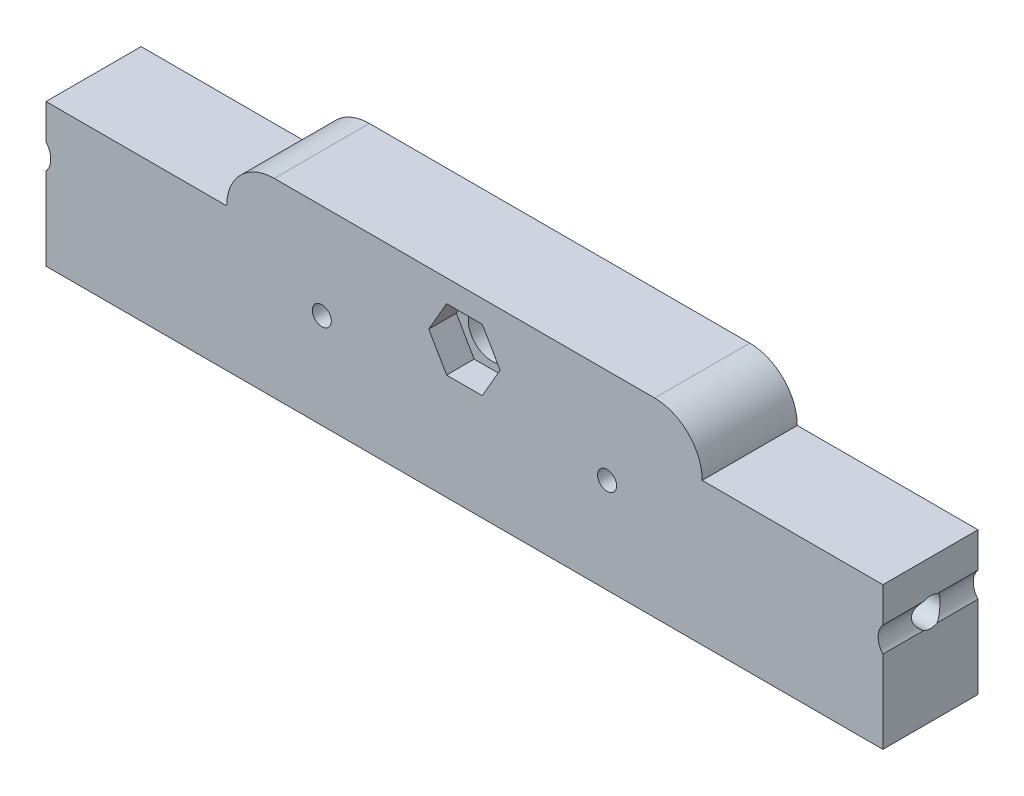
ISO-10303-21;
HEADER;
FILE_DESCRIPTION(('STEP AP214'),'2;1');
FILE_NAME('part.step','',(''),(''),'','','');
FILE_SCHEMA(('AUTOMOTIVE_DESIGN { 1 0 10303 214 1 1 1 1 }'));
ENDSEC;
DATA;
#1=APPLICATION_CONTEXT('core data for automotive mechanical design processes');
#2=APPLICATION_PROTOCOL_DEFINITION('international standard','automotive_design',2000,#1);
#3=PRODUCT_CONTEXT('',#1,'mechanical');
#4=PRODUCT('Part','Part','',(#3));
#5=PRODUCT_RELATED_PRODUCT_CATEGORY('part','',(#4));
#6=PRODUCT_DEFINITION_FORMATION('','',#4);
#7=PRODUCT_DEFINITION_CONTEXT('part definition',#1,'design');
#8=PRODUCT_DEFINITION('design','',#6,#7);
#9=PRODUCT_DEFINITION_SHAPE('','',#8);
#10=(LENGTH_UNIT() NAMED_UNIT(*) SI_UNIT(.MILLI.,.METRE.));
#11=(NAMED_UNIT(*) PLANE_ANGLE_UNIT() SI_UNIT($,.RADIAN.));
#12=(NAMED_UNIT(*) SI_UNIT($,.STERADIAN.) SOLID_ANGLE_UNIT());
#13=UNCERTAINTY_MEASURE_WITH_UNIT(LENGTH_MEASURE(1.E-05),#10,'distance_accuracy_value','');
#14=(GEOMETRIC_REPRESENTATION_CONTEXT(3) GLOBAL_UNCERTAINTY_ASSIGNED_CONTEXT((#13)) GLOBAL_UNIT_ASSIGNED_CONTEXT((#10,
#11,#12)) REPRESENTATION_CONTEXT('',''));
#15=CARTESIAN_POINT('',(0.,0.,0.));
#16=DIRECTION('',(0.,0.,1.));
#17=DIRECTION('',(1.,0.,0.));
#18=AXIS2_PLACEMENT_3D('',#15,#16,#17);
#19=CARTESIAN_POINT('',(-36.0445215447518,18.2909025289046,0.));
#20=DIRECTION('',(0.,0.,1.));
#21=DIRECTION('',(1.,0.,0.));
#22=AXIS2_PLACEMENT_3D('',#19,#20,#21);
#23=CYLINDRICAL_SURFACE('',#22,2.49999999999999);
#24=CARTESIAN_POINT('',(-36.0445215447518,18.2909025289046,0.));
#25=DIRECTION('',(0.,0.,1.));
#26=DIRECTION('',(1.,0.,0.));
#27=AXIS2_PLACEMENT_3D('',#24,#25,#26);
#28=CIRCLE('',#27,2.49999999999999);
#29=CARTESIAN_POINT('',(-33.5445215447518,18.2909025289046,0.));
#30=VERTEX_POINT('',#29);
#31=EDGE_CURVE('E294',#30,#30,#28,.T.);
#32=ORIENTED_EDGE('',*,*,#31,.F.);
#33=EDGE_LOOP('',(#32));
#34=FACE_BOUND('',#33,.T.);
#35=CARTESIAN_POINT('',(-36.0445215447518,18.2909025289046,7.1));
#36=DIRECTION('',(0.,0.,1.));
#37=DIRECTION('',(1.,0.,0.));
#38=AXIS2_PLACEMENT_3D('',#35,#36,#37);
#39=CIRCLE('',#38,2.49999999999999);
#40=CARTESIAN_POINT('',(-33.5445215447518,18.2909025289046,7.1));
#41=VERTEX_POINT('',#40);
#42=EDGE_CURVE('E235',#41,#41,#39,.F.);
#43=ORIENTED_EDGE('',*,*,#42,.F.);
#44=EDGE_LOOP('',(#43));
#45=FACE_BOUND('',#44,.T.);
#46=ADVANCED_FACE('F34',(#34,#45),#23,.F.);
#47=CARTESIAN_POINT('',(-80.0445215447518,18.8909025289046,10.));
#48=DIRECTION('',(1.,0.,0.));
#49=DIRECTION('',(0.,0.,-1.));
#50=AXIS2_PLACEMENT_3D('',#47,#48,#49);
#51=PLANE('',#50);
#52=DIRECTION('',(0.,-1.,0.));
#53=VECTOR('',#52,1.);
#54=CARTESIAN_POINT('',(-80.0445215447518,18.8909025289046,0.));
#55=LINE('',#54,#53);
#56=CARTESIAN_POINT('',(-80.0445215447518,18.8909025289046,0.));
#57=VERTEX_POINT('',#56);
#58=CARTESIAN_POINT('',(-80.0445215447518,15.213778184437,0.));
#59=VERTEX_POINT('',#58);
#60=EDGE_CURVE('E309',#57,#59,#55,.T.);
#61=ORIENTED_EDGE('',*,*,#60,.T.);
#62=DIRECTION('',(0.,0.,1.));
#63=VECTOR('',#62,1.);
#64=CARTESIAN_POINT('',(-80.0445215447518,15.213778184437,0.));
#65=LINE('',#64,#63);
#66=CARTESIAN_POINT('',(-80.0445215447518,15.213778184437,4.29289321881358));
#67=VERTEX_POINT('',#66);
#68=EDGE_CURVE('E250',#59,#67,#65,.T.);
#69=ORIENTED_EDGE('',*,*,#68,.T.);
#70=CARTESIAN_POINT('',(-80.0445215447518,13.8909025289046,5.));
#71=DIRECTION('',(-1.,0.,0.));
#72=DIRECTION('',(0.,0.,1.));
#73=AXIS2_PLACEMENT_3D('',#70,#71,#72);
#74=CIRCLE('',#73,1.5);
#75=CARTESIAN_POINT('',(-80.0445215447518,15.213778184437,5.70710678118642));
#76=VERTEX_POINT('',#75);
#77=EDGE_CURVE('E276',#76,#67,#74,.T.);
#78=ORIENTED_EDGE('',*,*,#77,.F.);
#79=CARTESIAN_POINT('',(-80.0445215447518,15.213778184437,10.));
#80=VERTEX_POINT('',#79);
#81=EDGE_CURVE('E254',#76,#80,#65,.T.);
#82=ORIENTED_EDGE('',*,*,#81,.T.);
#83=DIRECTION('',(0.,-1.,0.));
#84=VECTOR('',#83,1.);
#85=CARTESIAN_POINT('',(-80.0445215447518,18.8909025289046,10.));
#86=LINE('',#85,#84);
#87=CARTESIAN_POINT('',(-80.0445215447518,18.8909025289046,10.));
#88=VERTEX_POINT('',#87);
#89=EDGE_CURVE('E325',#88,#80,#86,.T.);
#90=ORIENTED_EDGE('',*,*,#89,.F.);
#91=DIRECTION('',(0.,0.,-1.));
#92=VECTOR('',#91,1.);
#93=CARTESIAN_POINT('',(-80.0445215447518,18.8909025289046,10.));
#94=LINE('',#93,#92);
#95=EDGE_CURVE('E336',#88,#57,#94,.T.);
#96=ORIENTED_EDGE('',*,*,#95,.T.);
#97=EDGE_LOOP('',(#61,#69,#78,#82,#90,#96));
#98=FACE_BOUND('',#97,.T.);
#99=ADVANCED_FACE('F387',(#98),#51,.F.);
#100=CARTESIAN_POINT('',(7.95547845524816,18.8909025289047,10.));
#101=DIRECTION('',(-1.,0.,0.));
#102=DIRECTION('',(0.,0.,1.));
#103=AXIS2_PLACEMENT_3D('',#100,#101,#102);
#104=PLANE('',#103);
#105=DIRECTION('',(0.,1.,0.));
#106=VECTOR('',#105,1.);
#107=CARTESIAN_POINT('',(7.95547845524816,18.8909025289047,0.));
#108=LINE('',#107,#106);
#109=CARTESIAN_POINT('',(7.95547845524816,3.89090252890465,0.));
#110=VERTEX_POINT('',#109);
#111=CARTESIAN_POINT('',(7.95547845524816,12.5680268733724,0.));
#112=VERTEX_POINT('',#111);
#113=EDGE_CURVE('E298',#110,#112,#108,.T.);
#114=ORIENTED_EDGE('',*,*,#113,.T.);
#115=DIRECTION('',(0.,0.,1.));
#116=VECTOR('',#115,1.);
#117=CARTESIAN_POINT('',(7.95547845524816,12.5680268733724,0.));
#118=LINE('',#117,#116);
#119=CARTESIAN_POINT('',(7.95547845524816,12.5680268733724,4.29289321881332));
#120=VERTEX_POINT('',#119);
#121=EDGE_CURVE('E267',#112,#120,#118,.T.);
#122=ORIENTED_EDGE('',*,*,#121,.T.);
#123=CARTESIAN_POINT('',(7.95547845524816,13.8909025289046,5.));
#124=DIRECTION('',(1.,0.,0.));
#125=DIRECTION('',(0.,1.,0.));
#126=AXIS2_PLACEMENT_3D('',#123,#124,#125);
#127=CIRCLE('',#126,1.5);
#128=CARTESIAN_POINT('',(7.95547845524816,12.5680268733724,5.70710678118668));
#129=VERTEX_POINT('',#128);
#130=EDGE_CURVE('E271',#129,#120,#127,.T.);
#131=ORIENTED_EDGE('',*,*,#130,.F.);
#132=CARTESIAN_POINT('',(7.95547845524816,12.5680268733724,10.));
#133=VERTEX_POINT('',#132);
#134=EDGE_CURVE('E263',#129,#133,#118,.T.);
#135=ORIENTED_EDGE('',*,*,#134,.T.);
#136=DIRECTION('',(0.,1.,0.));
#137=VECTOR('',#136,1.);
#138=CARTESIAN_POINT('',(7.95547845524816,18.8909025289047,10.));
#139=LINE('',#138,#137);
#140=CARTESIAN_POINT('',(7.95547845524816,3.89090252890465,10.));
#141=VERTEX_POINT('',#140);
#142=EDGE_CURVE('E315',#141,#133,#139,.T.);
#143=ORIENTED_EDGE('',*,*,#142,.F.);
#144=DIRECTION('',(0.,0.,-1.));
#145=VECTOR('',#144,1.);
#146=CARTESIAN_POINT('',(7.95547845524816,3.89090252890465,10.));
#147=LINE('',#146,#145);
#148=EDGE_CURVE('E330',#141,#110,#147,.T.);
#149=ORIENTED_EDGE('',*,*,#148,.T.);
#150=EDGE_LOOP('',(#114,#122,#131,#135,#143,#149));
#151=FACE_BOUND('',#150,.T.);
#152=ADVANCED_FACE('F393',(#151),#104,.F.);
#153=CARTESIAN_POINT('',(7.95547845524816,15.213778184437,10.));
#154=VERTEX_POINT('',#153);
#155=CARTESIAN_POINT('',(7.95547845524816,18.8909025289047,10.));
#156=VERTEX_POINT('',#155);
#157=EDGE_CURVE('E314',#154,#156,#139,.T.);
#158=ORIENTED_EDGE('',*,*,#157,.F.);
#159=DIRECTION('',(0.,0.,1.));
#160=VECTOR('',#159,1.);
#161=CARTESIAN_POINT('',(7.95547845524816,15.213778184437,0.));
#162=LINE('',#161,#160);
#163=CARTESIAN_POINT('',(7.95547845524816,15.213778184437,5.7071067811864));
#164=VERTEX_POINT('',#163);
#165=EDGE_CURVE('E260',#154,#164,#162,.F.);
#166=ORIENTED_EDGE('',*,*,#165,.T.);
#167=CARTESIAN_POINT('',(7.95547845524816,15.213778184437,4.2928932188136));
#168=VERTEX_POINT('',#167);
#169=EDGE_CURVE('E268',#168,#164,#127,.T.);
#170=ORIENTED_EDGE('',*,*,#169,.F.);
#171=CARTESIAN_POINT('',(7.95547845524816,15.213778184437,0.));
#172=VERTEX_POINT('',#171);
#173=EDGE_CURVE('E264',#168,#172,#162,.F.);
#174=ORIENTED_EDGE('',*,*,#173,.T.);
#175=CARTESIAN_POINT('',(7.95547845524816,18.8909025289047,0.));
#176=VERTEX_POINT('',#175);
#177=EDGE_CURVE('E297',#172,#176,#108,.T.);
#178=ORIENTED_EDGE('',*,*,#177,.T.);
#179=DIRECTION('',(0.,0.,-1.));
#180=VECTOR('',#179,1.);
#181=CARTESIAN_POINT('',(7.95547845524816,18.8909025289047,10.));
#182=LINE('',#181,#180);
#183=EDGE_CURVE('E345',#156,#176,#182,.T.);
#184=ORIENTED_EDGE('',*,*,#183,.F.);
#185=EDGE_LOOP('',(#158,#166,#170,#174,#178,#184));
#186=FACE_BOUND('',#185,.T.);
#187=ADVANCED_FACE('F36',(#186),#104,.F.);
#188=CARTESIAN_POINT('',(7.95547845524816,18.8909025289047,10.));
#189=DIRECTION('',(0.,-1.,0.));
#190=DIRECTION('',(0.,0.,-1.));
#191=AXIS2_PLACEMENT_3D('',#188,#189,#190);
#192=PLANE('',#191);
#193=DIRECTION('',(-1.,0.,0.));
#194=VECTOR('',#193,1.);
#195=CARTESIAN_POINT('',(7.95547845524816,18.8909025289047,0.));
#196=LINE('',#195,#194);
#197=CARTESIAN_POINT('',(-11.0445215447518,18.8909025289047,0.));
#198=VERTEX_POINT('',#197);
#199=EDGE_CURVE('E301',#176,#198,#196,.T.);
#200=ORIENTED_EDGE('',*,*,#199,.T.);
#201=DIRECTION('',(0.,0.,-1.));
#202=VECTOR('',#201,1.);
#203=CARTESIAN_POINT('',(-11.0445215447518,18.8909025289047,10.));
#204=LINE('',#203,#202);
#205=CARTESIAN_POINT('',(-11.0445215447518,18.8909025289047,10.));
#206=VERTEX_POINT('',#205);
#207=EDGE_CURVE('E342',#206,#198,#204,.T.);
#208=ORIENTED_EDGE('',*,*,#207,.F.);
#209=DIRECTION('',(-1.,0.,0.));
#210=VECTOR('',#209,1.);
#211=CARTESIAN_POINT('',(7.95547845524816,18.8909025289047,10.));
#212=LINE('',#211,#210);
#213=EDGE_CURVE('E318',#156,#206,#212,.T.);
#214=ORIENTED_EDGE('',*,*,#213,.F.);
#215=ORIENTED_EDGE('',*,*,#183,.T.);
#216=EDGE_LOOP('',(#200,#208,#214,#215));
#217=FACE_BOUND('',#216,.T.);
#218=ADVANCED_FACE('F421',(#217),#192,.F.);
#219=CARTESIAN_POINT('',(-61.0445215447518,23.8909025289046,10.));
#220=DIRECTION('',(0.,-1.,0.));
#221=DIRECTION('',(1.,0.,0.));
#222=AXIS2_PLACEMENT_3D('',#219,#220,#221);
#223=PLANE('',#222);
#224=DIRECTION('',(-1.,0.,0.));
#225=VECTOR('',#224,1.);
#226=CARTESIAN_POINT('',(-61.0445215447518,23.8909025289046,10.));
#227=LINE('',#226,#225);
#228=CARTESIAN_POINT('',(-16.0445215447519,23.8909025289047,10.));
#229=VERTEX_POINT('',#228);
#230=CARTESIAN_POINT('',(-56.0445215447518,23.8909025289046,10.));
#231=VERTEX_POINT('',#230);
#232=EDGE_CURVE('E320',#229,#231,#227,.T.);
#233=ORIENTED_EDGE('',*,*,#232,.F.);
#234=DIRECTION('',(0.,0.,-1.));
#235=VECTOR('',#234,1.);
#236=CARTESIAN_POINT('',(-16.0445215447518,23.8909025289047,10.));
#237=LINE('',#236,#235);
#238=CARTESIAN_POINT('',(-16.0445215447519,23.8909025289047,0.));
#239=VERTEX_POINT('',#238);
#240=EDGE_CURVE('E439',#229,#239,#237,.T.);
#241=ORIENTED_EDGE('',*,*,#240,.T.);
#242=DIRECTION('',(-1.,0.,0.));
#243=VECTOR('',#242,1.);
#244=CARTESIAN_POINT('',(-61.0445215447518,23.8909025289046,0.));
#245=LINE('',#244,#243);
#246=CARTESIAN_POINT('',(-56.0445215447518,23.8909025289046,0.));
#247=VERTEX_POINT('',#246);
#248=EDGE_CURVE('E304',#239,#247,#245,.T.);
#249=ORIENTED_EDGE('',*,*,#248,.T.);
#250=DIRECTION('',(0.,0.,-1.));
#251=VECTOR('',#250,1.);
#252=CARTESIAN_POINT('',(-56.0445215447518,23.8909025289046,10.));
#253=LINE('',#252,#251);
#254=EDGE_CURVE('E49',#247,#231,#253,.F.);
#255=ORIENTED_EDGE('',*,*,#254,.T.);
#256=EDGE_LOOP('',(#233,#241,#249,#255));
#257=FACE_BOUND('',#256,.T.);
#258=ADVANCED_FACE('F418',(#257),#223,.F.);
#259=CARTESIAN_POINT('',(-61.0445215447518,18.8909025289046,10.));
#260=DIRECTION('',(0.,-1.,0.));
#261=DIRECTION('',(0.,0.,-1.));
#262=AXIS2_PLACEMENT_3D('',#259,#260,#261);
#263=PLANE('',#262);
#264=DIRECTION('',(-1.,0.,0.));
#265=VECTOR('',#264,1.);
#266=CARTESIAN_POINT('',(-61.0445215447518,18.8909025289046,0.));
#267=LINE('',#266,#265);
#268=CARTESIAN_POINT('',(-61.0445215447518,18.8909025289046,0.));
#269=VERTEX_POINT('',#268);
#270=EDGE_CURVE('E306',#269,#57,#267,.T.);
#271=ORIENTED_EDGE('',*,*,#270,.T.);
#272=ORIENTED_EDGE('',*,*,#95,.F.);
#273=DIRECTION('',(-1.,0.,0.));
#274=VECTOR('',#273,1.);
#275=CARTESIAN_POINT('',(-61.0445215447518,18.8909025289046,10.));
#276=LINE('',#275,#274);
#277=CARTESIAN_POINT('',(-61.0445215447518,18.8909025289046,10.));
#278=VERTEX_POINT('',#277);
#279=EDGE_CURVE('E322',#278,#88,#276,.T.);
#280=ORIENTED_EDGE('',*,*,#279,.F.);
#281=DIRECTION('',(0.,0.,-1.));
#282=VECTOR('',#281,1.);
#283=CARTESIAN_POINT('',(-61.0445215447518,18.8909025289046,10.));
#284=LINE('',#283,#282);
#285=EDGE_CURVE('E339',#278,#269,#284,.T.);
#286=ORIENTED_EDGE('',*,*,#285,.T.);
#287=EDGE_LOOP('',(#271,#272,#280,#286));
#288=FACE_BOUND('',#287,.T.);
#289=ADVANCED_FACE('F414',(#288),#263,.F.);
#290=CARTESIAN_POINT('',(-80.0445215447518,12.5680268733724,10.));
#291=VERTEX_POINT('',#290);
#292=CARTESIAN_POINT('',(-80.0445215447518,3.89090252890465,10.));
#293=VERTEX_POINT('',#292);
#294=EDGE_CURVE('E324',#291,#293,#86,.T.);
#295=ORIENTED_EDGE('',*,*,#294,.F.);
#296=DIRECTION('',(0.,0.,1.));
#297=VECTOR('',#296,1.);
#298=CARTESIAN_POINT('',(-80.0445215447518,12.5680268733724,0.));
#299=LINE('',#298,#297);
#300=CARTESIAN_POINT('',(-80.0445215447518,12.5680268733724,5.70710678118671));
#301=VERTEX_POINT('',#300);
#302=EDGE_CURVE('E251',#291,#301,#299,.F.);
#303=ORIENTED_EDGE('',*,*,#302,.T.);
#304=CARTESIAN_POINT('',(-80.0445215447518,12.5680268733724,4.29289321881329));
#305=VERTEX_POINT('',#304);
#306=EDGE_CURVE('E275',#305,#301,#74,.T.);
#307=ORIENTED_EDGE('',*,*,#306,.F.);
#308=CARTESIAN_POINT('',(-80.0445215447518,12.5680268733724,0.));
#309=VERTEX_POINT('',#308);
#310=EDGE_CURVE('E247',#305,#309,#299,.F.);
#311=ORIENTED_EDGE('',*,*,#310,.T.);
#312=CARTESIAN_POINT('',(-80.0445215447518,3.89090252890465,0.));
#313=VERTEX_POINT('',#312);
#314=EDGE_CURVE('E308',#309,#313,#55,.T.);
#315=ORIENTED_EDGE('',*,*,#314,.T.);
#316=DIRECTION('',(0.,0.,-1.));
#317=VECTOR('',#316,1.);
#318=CARTESIAN_POINT('',(-80.0445215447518,3.89090252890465,10.));
#319=LINE('',#318,#317);
#320=EDGE_CURVE('E333',#293,#313,#319,.T.);
#321=ORIENTED_EDGE('',*,*,#320,.F.);
#322=EDGE_LOOP('',(#295,#303,#307,#311,#315,#321));
#323=FACE_BOUND('',#322,.T.);
#324=ADVANCED_FACE('F396',(#323),#51,.F.);
#325=CARTESIAN_POINT('',(-80.0445215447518,3.89090252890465,10.));
#326=DIRECTION('',(0.,1.,0.));
#327=DIRECTION('',(0.,0.,1.));
#328=AXIS2_PLACEMENT_3D('',#325,#326,#327);
#329=PLANE('',#328);
#330=DIRECTION('',(1.,0.,0.));
#331=VECTOR('',#330,1.);
#332=CARTESIAN_POINT('',(-80.0445215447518,3.89090252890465,0.));
#333=LINE('',#332,#331);
#334=EDGE_CURVE('E312',#313,#110,#333,.T.);
#335=ORIENTED_EDGE('',*,*,#334,.T.);
#336=ORIENTED_EDGE('',*,*,#148,.F.);
#337=DIRECTION('',(1.,0.,0.));
#338=VECTOR('',#337,1.);
#339=CARTESIAN_POINT('',(-80.0445215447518,3.89090252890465,10.));
#340=LINE('',#339,#338);
#341=EDGE_CURVE('E328',#293,#141,#340,.T.);
#342=ORIENTED_EDGE('',*,*,#341,.F.);
#343=ORIENTED_EDGE('',*,*,#320,.T.);
#344=EDGE_LOOP('',(#335,#336,#342,#343));
#345=FACE_BOUND('',#344,.T.);
#346=ADVANCED_FACE('F409',(#345),#329,.F.);
#347=CARTESIAN_POINT('',(7.95547845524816,3.89090252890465,10.));
#348=DIRECTION('',(0.,0.,1.));
#349=DIRECTION('',(1.,0.,0.));
#350=AXIS2_PLACEMENT_3D('',#347,#348,#349);
#351=PLANE('',#350);
#352=DIRECTION('',(1.,0.,0.));
#353=VECTOR('',#352,1.);
#354=CARTESIAN_POINT('',(-37.9209099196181,15.0409025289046,10.));
#355=LINE('',#354,#353);
#356=CARTESIAN_POINT('',(-37.9209099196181,15.0409025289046,10.));
#357=VERTEX_POINT('',#356);
#358=CARTESIAN_POINT('',(-34.1681331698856,15.0409025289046,10.));
#359=VERTEX_POINT('',#358);
#360=EDGE_CURVE('E202',#357,#359,#355,.T.);
#361=ORIENTED_EDGE('',*,*,#360,.F.);
#362=DIRECTION('',(0.5,-0.866025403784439,0.));
#363=VECTOR('',#362,1.);
#364=CARTESIAN_POINT('',(-39.7972982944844,18.2909025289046,10.));
#365=LINE('',#364,#363);
#366=CARTESIAN_POINT('',(-39.7972982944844,18.2909025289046,10.));
#367=VERTEX_POINT('',#366);
#368=EDGE_CURVE('E215',#367,#357,#365,.T.);
#369=ORIENTED_EDGE('',*,*,#368,.F.);
#370=DIRECTION('',(-0.5,-0.866025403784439,0.));
#371=VECTOR('',#370,1.);
#372=CARTESIAN_POINT('',(-37.9209099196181,21.5409025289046,10.));
#373=LINE('',#372,#371);
#374=CARTESIAN_POINT('',(-37.9209099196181,21.5409025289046,10.));
#375=VERTEX_POINT('',#374);
#376=EDGE_CURVE('E209',#375,#367,#373,.T.);
#377=ORIENTED_EDGE('',*,*,#376,.F.);
#378=DIRECTION('',(-1.,0.,0.));
#379=VECTOR('',#378,1.);
#380=CARTESIAN_POINT('',(-34.1681331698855,21.5409025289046,10.));
#381=LINE('',#380,#379);
#382=CARTESIAN_POINT('',(-34.1681331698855,21.5409025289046,10.));
#383=VERTEX_POINT('',#382);
#384=EDGE_CURVE('E207',#383,#375,#381,.T.);
#385=ORIENTED_EDGE('',*,*,#384,.F.);
#386=DIRECTION('',(-0.5,0.866025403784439,0.));
#387=VECTOR('',#386,1.);
#388=CARTESIAN_POINT('',(-32.2917447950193,18.2909025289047,10.));
#389=LINE('',#388,#387);
#390=CARTESIAN_POINT('',(-32.2917447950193,18.2909025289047,10.));
#391=VERTEX_POINT('',#390);
#392=EDGE_CURVE('E186',#391,#383,#389,.T.);
#393=ORIENTED_EDGE('',*,*,#392,.F.);
#394=DIRECTION('',(0.499999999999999,0.866025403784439,0.));
#395=VECTOR('',#394,1.);
#396=CARTESIAN_POINT('',(-34.1681331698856,15.0409025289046,10.));
#397=LINE('',#396,#395);
#398=EDGE_CURVE('E198',#359,#391,#397,.T.);
#399=ORIENTED_EDGE('',*,*,#398,.F.);
#400=EDGE_LOOP('',(#361,#369,#377,#385,#393,#399));
#401=FACE_BOUND('',#400,.T.);
#402=ORIENTED_EDGE('',*,*,#213,.T.);
#403=CARTESIAN_POINT('',(-16.0445215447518,18.8909025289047,10.));
#404=DIRECTION('',(0.,0.,1.));
#405=DIRECTION('',(1.,0.,0.));
#406=AXIS2_PLACEMENT_3D('',#403,#404,#405);
#407=CIRCLE('',#406,5.);
#408=EDGE_CURVE('E12',#206,#229,#407,.T.);
#409=ORIENTED_EDGE('',*,*,#408,.T.);
#410=ORIENTED_EDGE('',*,*,#232,.T.);
#411=CARTESIAN_POINT('',(-56.0445215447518,18.8909025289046,10.));
#412=DIRECTION('',(0.,0.,1.));
#413=DIRECTION('',(1.,0.,0.));
#414=AXIS2_PLACEMENT_3D('',#411,#412,#413);
#415=CIRCLE('',#414,5.);
#416=EDGE_CURVE('E42',#231,#278,#415,.T.);
#417=ORIENTED_EDGE('',*,*,#416,.T.);
#418=ORIENTED_EDGE('',*,*,#279,.T.);
#419=ORIENTED_EDGE('',*,*,#89,.T.);
#420=CARTESIAN_POINT('',(-81.5445215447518,13.8909025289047,10.));
#421=DIRECTION('',(0.,0.,1.));
#422=DIRECTION('',(1.,0.,0.));
#423=AXIS2_PLACEMENT_3D('',#420,#421,#422);
#424=CIRCLE('',#423,2.);
#425=EDGE_CURVE('E242',#291,#80,#424,.T.);
#426=ORIENTED_EDGE('',*,*,#425,.F.);
#427=ORIENTED_EDGE('',*,*,#294,.T.);
#428=ORIENTED_EDGE('',*,*,#341,.T.);
#429=ORIENTED_EDGE('',*,*,#142,.T.);
#430=CARTESIAN_POINT('',(9.45547845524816,13.8909025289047,10.));
#431=DIRECTION('',(0.,0.,1.));
#432=DIRECTION('',(1.,0.,0.));
#433=AXIS2_PLACEMENT_3D('',#430,#431,#432);
#434=CIRCLE('',#433,2.00000000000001);
#435=EDGE_CURVE('E255',#154,#133,#434,.T.);
#436=ORIENTED_EDGE('',*,*,#435,.F.);
#437=ORIENTED_EDGE('',*,*,#157,.T.);
#438=EDGE_LOOP('',(#402,#409,#410,#417,#418,#419,#426,#427,#428,#429,#436,#437));
#439=FACE_BOUND('',#438,.T.);
#440=CARTESIAN_POINT('',(-51.0445215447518,13.8909025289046,10.));
#441=DIRECTION('',(0.,0.,1.));
#442=DIRECTION('',(1.,0.,0.));
#443=AXIS2_PLACEMENT_3D('',#440,#441,#442);
#444=CIRCLE('',#443,0.999999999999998);
#445=CARTESIAN_POINT('',(-50.0445215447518,13.8909025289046,10.));
#446=VERTEX_POINT('',#445);
#447=EDGE_CURVE('E282',#446,#446,#444,.T.);
#448=ORIENTED_EDGE('',*,*,#447,.F.);
#449=EDGE_LOOP('',(#448));
#450=FACE_BOUND('',#449,.T.);
#451=CARTESIAN_POINT('',(-21.0445215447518,13.8909025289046,10.));
#452=DIRECTION('',(0.,0.,1.));
#453=DIRECTION('',(1.,0.,0.));
#454=AXIS2_PLACEMENT_3D('',#451,#452,#453);
#455=CIRCLE('',#454,1.);
#456=CARTESIAN_POINT('',(-20.0445215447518,13.8909025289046,10.));
#457=VERTEX_POINT('',#456);
#458=EDGE_CURVE('E288',#457,#457,#455,.T.);
#459=ORIENTED_EDGE('',*,*,#458,.F.);
#460=EDGE_LOOP('',(#459));
#461=FACE_BOUND('',#460,.T.);
#462=ADVANCED_FACE('F204',(#401,#439,#450,#461),#351,.T.);
#463=CARTESIAN_POINT('',(7.95547845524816,3.89090252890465,0.));
#464=DIRECTION('',(0.,0.,1.));
#465=DIRECTION('',(1.,0.,0.));
#466=AXIS2_PLACEMENT_3D('',#463,#464,#465);
#467=PLANE('',#466);
#468=CARTESIAN_POINT('',(-51.0445215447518,13.8909025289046,0.));
#469=DIRECTION('',(0.,0.,1.));
#470=DIRECTION('',(1.,0.,0.));
#471=AXIS2_PLACEMENT_3D('',#468,#469,#470);
#472=CIRCLE('',#471,0.999999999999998);
#473=CARTESIAN_POINT('',(-50.0445215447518,13.8909025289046,0.));
#474=VERTEX_POINT('',#473);
#475=EDGE_CURVE('E285',#474,#474,#472,.T.);
#476=ORIENTED_EDGE('',*,*,#475,.T.);
#477=EDGE_LOOP('',(#476));
#478=FACE_BOUND('',#477,.T.);
#479=CARTESIAN_POINT('',(-21.0445215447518,13.8909025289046,0.));
#480=DIRECTION('',(0.,0.,1.));
#481=DIRECTION('',(1.,0.,0.));
#482=AXIS2_PLACEMENT_3D('',#479,#480,#481);
#483=CIRCLE('',#482,1.);
#484=CARTESIAN_POINT('',(-20.0445215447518,13.8909025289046,0.));
#485=VERTEX_POINT('',#484);
#486=EDGE_CURVE('E291',#485,#485,#483,.T.);
#487=ORIENTED_EDGE('',*,*,#486,.T.);
#488=EDGE_LOOP('',(#487));
#489=FACE_BOUND('',#488,.T.);
#490=ORIENTED_EDGE('',*,*,#31,.T.);
#491=EDGE_LOOP('',(#490));
#492=FACE_BOUND('',#491,.T.);
#493=ORIENTED_EDGE('',*,*,#248,.F.);
#494=CARTESIAN_POINT('',(-16.0445215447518,18.8909025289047,0.));
#495=DIRECTION('',(0.,0.,1.));
#496=DIRECTION('',(1.,0.,0.));
#497=AXIS2_PLACEMENT_3D('',#494,#495,#496);
#498=CIRCLE('',#497,5.);
#499=EDGE_CURVE('E437',#239,#198,#498,.F.);
#500=ORIENTED_EDGE('',*,*,#499,.T.);
#501=ORIENTED_EDGE('',*,*,#199,.F.);
#502=ORIENTED_EDGE('',*,*,#177,.F.);
#503=CARTESIAN_POINT('',(9.45547845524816,13.8909025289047,0.));
#504=DIRECTION('',(0.,0.,1.));
#505=DIRECTION('',(1.,0.,0.));
#506=AXIS2_PLACEMENT_3D('',#503,#504,#505);
#507=CIRCLE('',#506,2.00000000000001);
#508=EDGE_CURVE('E257',#172,#112,#507,.T.);
#509=ORIENTED_EDGE('',*,*,#508,.T.);
#510=ORIENTED_EDGE('',*,*,#113,.F.);
#511=ORIENTED_EDGE('',*,*,#334,.F.);
#512=ORIENTED_EDGE('',*,*,#314,.F.);
#513=CARTESIAN_POINT('',(-81.5445215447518,13.8909025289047,0.));
#514=DIRECTION('',(0.,0.,1.));
#515=DIRECTION('',(1.,0.,0.));
#516=AXIS2_PLACEMENT_3D('',#513,#514,#515);
#517=CIRCLE('',#516,2.);
#518=EDGE_CURVE('E244',#309,#59,#517,.T.);
#519=ORIENTED_EDGE('',*,*,#518,.T.);
#520=ORIENTED_EDGE('',*,*,#60,.F.);
#521=ORIENTED_EDGE('',*,*,#270,.F.);
#522=CARTESIAN_POINT('',(-56.0445215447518,18.8909025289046,0.));
#523=DIRECTION('',(0.,0.,1.));
#524=DIRECTION('',(1.,0.,0.));
#525=AXIS2_PLACEMENT_3D('',#522,#523,#524);
#526=CIRCLE('',#525,5.);
#527=EDGE_CURVE('E441',#269,#247,#526,.F.);
#528=ORIENTED_EDGE('',*,*,#527,.T.);
#529=EDGE_LOOP('',(#493,#500,#501,#502,#509,#510,#511,#512,#519,#520,#521,#528));
#530=FACE_BOUND('',#529,.T.);
#531=ADVANCED_FACE('F403',(#478,#489,#492,#530),#467,.F.);
#532=CARTESIAN_POINT('',(-21.0445215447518,13.8909025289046,0.));
#533=DIRECTION('',(0.,0.,1.));
#534=DIRECTION('',(1.,0.,0.));
#535=AXIS2_PLACEMENT_3D('',#532,#533,#534);
#536=CYLINDRICAL_SURFACE('',#535,1.);
#537=ORIENTED_EDGE('',*,*,#486,.F.);
#538=EDGE_LOOP('',(#537));
#539=FACE_BOUND('',#538,.T.);
#540=ORIENTED_EDGE('',*,*,#458,.T.);
#541=EDGE_LOOP('',(#540));
#542=FACE_BOUND('',#541,.T.);
#543=ADVANCED_FACE('F401',(#539,#542),#536,.F.);
#544=CARTESIAN_POINT('',(-51.0445215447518,13.8909025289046,0.));
#545=DIRECTION('',(0.,0.,1.));
#546=DIRECTION('',(1.,0.,0.));
#547=AXIS2_PLACEMENT_3D('',#544,#545,#546);
#548=CYLINDRICAL_SURFACE('',#547,0.999999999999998);
#549=ORIENTED_EDGE('',*,*,#475,.F.);
#550=EDGE_LOOP('',(#549));
#551=FACE_BOUND('',#550,.T.);
#552=ORIENTED_EDGE('',*,*,#447,.T.);
#553=EDGE_LOOP('',(#552));
#554=FACE_BOUND('',#553,.T.);
#555=ADVANCED_FACE('F498',(#551,#554),#548,.F.);
#556=CARTESIAN_POINT('',(-70.0445215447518,13.8909025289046,5.));
#557=DIRECTION('',(-1.,0.,0.));
#558=DIRECTION('',(0.,0.,1.));
#559=AXIS2_PLACEMENT_3D('',#556,#557,#558);
#560=CYLINDRICAL_SURFACE('',#559,1.5);
#561=CARTESIAN_POINT('',(-70.0445215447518,13.8909025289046,5.));
#562=DIRECTION('',(-1.,0.,0.));
#563=DIRECTION('',(0.,0.,1.));
#564=AXIS2_PLACEMENT_3D('',#561,#562,#563);
#565=CIRCLE('',#564,1.5);
#566=CARTESIAN_POINT('',(-70.0445215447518,13.8909025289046,6.5));
#567=VERTEX_POINT('',#566);
#568=EDGE_CURVE('E279',#567,#567,#565,.T.);
#569=ORIENTED_EDGE('',*,*,#568,.F.);
#570=EDGE_LOOP('',(#569));
#571=FACE_BOUND('',#570,.T.);
#572=ORIENTED_EDGE('',*,*,#306,.T.);
#573=CARTESIAN_POINT('',(-80.0445215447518,12.5680268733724,5.70710678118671));
#574=CARTESIAN_POINT('',(-80.0256539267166,12.5894105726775,5.74708682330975));
#575=CARTESIAN_POINT('',(-80.0061536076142,12.6124532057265,5.78585927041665));
#576=CARTESIAN_POINT('',(-79.9664869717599,12.6617563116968,5.86094509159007));
#577=CARTESIAN_POINT('',(-79.9463206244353,12.6880169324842,5.89725835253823));
#578=CARTESIAN_POINT('',(-79.9057187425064,12.7439355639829,5.96773308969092));
#579=CARTESIAN_POINT('',(-79.8852825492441,12.7736252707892,6.00186906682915));
#580=CARTESIAN_POINT('',(-79.8448772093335,12.8361064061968,6.06745382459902));
#581=CARTESIAN_POINT('',(-79.8249080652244,12.8688978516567,6.09890259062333));
#582=CARTESIAN_POINT('',(-79.7663561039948,12.9720051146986,6.18910838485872));
#583=CARTESIAN_POINT('',(-79.7291856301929,13.0469789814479,6.24363000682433));
#584=CARTESIAN_POINT('',(-79.6627232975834,13.2079994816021,6.33877218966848));
#585=CARTESIAN_POINT('',(-79.6333932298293,13.2939892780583,6.37946043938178));
#586=CARTESIAN_POINT('',(-79.5929080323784,13.4486098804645,6.43493475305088));
#587=CARTESIAN_POINT('',(-79.5789489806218,13.5150472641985,6.45381026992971));
#588=CARTESIAN_POINT('',(-79.5577807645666,13.6509500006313,6.48230634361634));
#589=CARTESIAN_POINT('',(-79.5505695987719,13.7204144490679,6.49192964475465));
#590=CARTESIAN_POINT('',(-79.5435189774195,13.8605462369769,6.50133973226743));
#591=CARTESIAN_POINT('',(-79.5436962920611,13.9312159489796,6.50110414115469));
#592=CARTESIAN_POINT('',(-79.5514468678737,14.071413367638,6.49075759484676));
#593=CARTESIAN_POINT('',(-79.5590211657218,14.1409409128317,6.48064525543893));
#594=CARTESIAN_POINT('',(-79.5805499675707,14.274643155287,6.45164547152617));
#595=CARTESIAN_POINT('',(-79.5942888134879,14.3389184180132,6.43305431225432));
#596=CARTESIAN_POINT('',(-79.627077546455,14.4632183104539,6.38810206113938));
#597=CARTESIAN_POINT('',(-79.6461281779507,14.5232423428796,6.3617398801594));
#598=CARTESIAN_POINT('',(-79.690691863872,14.6445162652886,6.29893362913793));
#599=CARTESIAN_POINT('',(-79.7166845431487,14.7051785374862,6.26170090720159));
#600=CARTESIAN_POINT('',(-79.7721202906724,14.8196940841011,6.17996153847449));
#601=CARTESIAN_POINT('',(-79.8015682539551,14.8735374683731,6.13544453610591));
#602=CARTESIAN_POINT('',(-79.867043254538,14.9820881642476,6.03236318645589));
#603=CARTESIAN_POINT('',(-79.9033715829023,15.0355698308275,5.9726907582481));
#604=CARTESIAN_POINT('',(-79.9573467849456,15.1081892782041,5.87738437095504));
#605=CARTESIAN_POINT('',(-79.9752313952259,15.131105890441,5.84469148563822));
#606=CARTESIAN_POINT('',(-80.0104186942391,15.1743774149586,5.77735910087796));
#607=CARTESIAN_POINT('',(-80.0277214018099,15.1947324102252,5.74271966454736));
#608=CARTESIAN_POINT('',(-80.0445215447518,15.213778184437,5.70710678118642));
#609=B_SPLINE_CURVE_WITH_KNOTS('',3,(#573,#574,#575,#576,#577,#578,#579,#580,#581,#582,#583,
#584,#585,#586,#587,#588,#589,#590,#591,#592,#593,#594,#595,#596,#597,#598,#599,#600,#601,#602,
#603,#604,#605,#606,#607,#608),.UNSPECIFIED.,.F.,.F.,(4,2,2,2,2,2,2,2,2,2,2,2,2,2,2,2,2,4),(0.,
0.147252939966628,0.294512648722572,0.443262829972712,0.592013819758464,0.889911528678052,
1.18632986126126,1.39682529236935,1.60725826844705,1.81816890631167,2.02910910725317,
2.23318451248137,2.43728853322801,2.66377865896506,2.8905936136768,3.15349717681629,
3.28463821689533,3.41577500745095),.UNSPECIFIED.);
#610=EDGE_CURVE('E444',#301,#76,#609,.T.);
#611=ORIENTED_EDGE('',*,*,#610,.T.);
#612=ORIENTED_EDGE('',*,*,#77,.T.);
#613=CARTESIAN_POINT('',(-80.0445215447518,15.213778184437,4.29289321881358));
#614=CARTESIAN_POINT('',(-80.0256539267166,15.1923944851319,4.25291317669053));
#615=CARTESIAN_POINT('',(-80.0061536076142,15.1693518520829,4.21414072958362));
#616=CARTESIAN_POINT('',(-79.9664869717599,15.1200487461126,4.13905490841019));
#617=CARTESIAN_POINT('',(-79.9463206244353,15.0937881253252,4.10274164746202));
#618=CARTESIAN_POINT('',(-79.9057187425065,15.0378694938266,4.03226691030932));
#619=CARTESIAN_POINT('',(-79.8852825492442,15.0081797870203,3.99813093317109));
#620=CARTESIAN_POINT('',(-79.8448772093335,14.9456986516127,3.9325461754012));
#621=CARTESIAN_POINT('',(-79.8249080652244,14.9129072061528,3.9010974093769));
#622=CARTESIAN_POINT('',(-79.7663561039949,14.8097999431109,3.81089161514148));
#623=CARTESIAN_POINT('',(-79.729185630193,14.7348260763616,3.75636999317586));
#624=CARTESIAN_POINT('',(-79.6627232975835,14.5738055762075,3.66122781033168));
#625=CARTESIAN_POINT('',(-79.6333932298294,14.4878157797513,3.62053956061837));
#626=CARTESIAN_POINT('',(-79.5929080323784,14.3331951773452,3.56506524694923));
#627=CARTESIAN_POINT('',(-79.5789489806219,14.2667577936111,3.54618973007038));
#628=CARTESIAN_POINT('',(-79.5577807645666,14.1308550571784,3.51769365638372));
#629=CARTESIAN_POINT('',(-79.5505695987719,14.0613906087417,3.50807035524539));
#630=CARTESIAN_POINT('',(-79.5435189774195,13.9212588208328,3.49866026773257));
#631=CARTESIAN_POINT('',(-79.5436962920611,13.85058910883,3.4988958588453));
#632=CARTESIAN_POINT('',(-79.5514468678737,13.7103916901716,3.5092424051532));
#633=CARTESIAN_POINT('',(-79.5590211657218,13.6408641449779,3.51935474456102));
#634=CARTESIAN_POINT('',(-79.5805499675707,13.5071619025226,3.54835452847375));
#635=CARTESIAN_POINT('',(-79.5942888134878,13.4428866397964,3.56694568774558));
#636=CARTESIAN_POINT('',(-79.6270775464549,13.3185867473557,3.61189793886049));
#637=CARTESIAN_POINT('',(-79.6461281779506,13.2585627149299,3.63826011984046));
#638=CARTESIAN_POINT('',(-79.690691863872,13.137288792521,3.7010663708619));
#639=CARTESIAN_POINT('',(-79.7166845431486,13.0766265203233,3.73829909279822));
#640=CARTESIAN_POINT('',(-79.7721202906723,12.9621109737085,3.82003846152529));
#641=CARTESIAN_POINT('',(-79.8015682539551,12.9082675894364,3.86455546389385));
#642=CARTESIAN_POINT('',(-79.8670432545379,12.7997168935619,3.96763681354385));
#643=CARTESIAN_POINT('',(-79.9033715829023,12.746235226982,4.02730924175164));
#644=CARTESIAN_POINT('',(-79.9573467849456,12.6736157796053,4.12261562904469));
#645=CARTESIAN_POINT('',(-79.9752313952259,12.6506991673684,4.1553085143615));
#646=CARTESIAN_POINT('',(-80.0104186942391,12.6074276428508,4.22264089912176));
#647=CARTESIAN_POINT('',(-80.0277214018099,12.5870726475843,4.25728033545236));
#648=CARTESIAN_POINT('',(-80.0445215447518,12.5680268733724,4.2928932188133));
#649=B_SPLINE_CURVE_WITH_KNOTS('',3,(#613,#614,#615,#616,#617,#618,#619,#620,#621,#622,#623,
#624,#625,#626,#627,#628,#629,#630,#631,#632,#633,#634,#635,#636,#637,#638,#639,#640,#641,#642,
#643,#644,#645,#646,#647,#648),.UNSPECIFIED.,.F.,.F.,(4,2,2,2,2,2,2,2,2,2,2,2,2,2,2,2,2,4),(0.,
0.14725293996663,0.294512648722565,0.443262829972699,0.592013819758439,0.889911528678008,
1.1863298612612,1.39682529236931,1.60725826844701,1.81816890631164,2.02910910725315,
2.23318451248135,2.43728853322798,2.66377865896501,2.89059361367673,3.15349717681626,
3.28463821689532,3.41577500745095),.UNSPECIFIED.);
#650=EDGE_CURVE('E483',#67,#305,#649,.T.);
#651=ORIENTED_EDGE('',*,*,#650,.T.);
#652=EDGE_LOOP('',(#572,#611,#612,#651));
#653=FACE_BOUND('',#652,.T.);
#654=ADVANCED_FACE('F495',(#571,#653),#560,.F.);
#655=CARTESIAN_POINT('',(-70.0445215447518,13.8909025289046,5.));
#656=DIRECTION('',(-1.,0.,0.));
#657=DIRECTION('',(0.,0.,1.));
#658=AXIS2_PLACEMENT_3D('',#655,#656,#657);
#659=PLANE('',#658);
#660=ORIENTED_EDGE('',*,*,#568,.T.);
#661=EDGE_LOOP('',(#660));
#662=FACE_BOUND('',#661,.T.);
#663=ADVANCED_FACE('F384',(#662),#659,.T.);
#664=CARTESIAN_POINT('',(-2.04452154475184,13.8909025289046,5.));
#665=DIRECTION('',(1.,0.,0.));
#666=DIRECTION('',(0.,1.,0.));
#667=AXIS2_PLACEMENT_3D('',#664,#665,#666);
#668=CYLINDRICAL_SURFACE('',#667,1.5);
#669=CARTESIAN_POINT('',(-2.04452154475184,13.8909025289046,5.));
#670=DIRECTION('',(1.,0.,0.));
#671=DIRECTION('',(0.,1.,0.));
#672=AXIS2_PLACEMENT_3D('',#669,#670,#671);
#673=CIRCLE('',#672,1.5);
#674=CARTESIAN_POINT('',(-2.04452154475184,15.3909025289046,5.));
#675=VERTEX_POINT('',#674);
#676=EDGE_CURVE('E272',#675,#675,#673,.T.);
#677=ORIENTED_EDGE('',*,*,#676,.F.);
#678=EDGE_LOOP('',(#677));
#679=FACE_BOUND('',#678,.T.);
#680=ORIENTED_EDGE('',*,*,#130,.T.);
#681=CARTESIAN_POINT('',(7.95547845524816,12.5680268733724,4.29289321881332));
#682=CARTESIAN_POINT('',(7.9366108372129,12.5894105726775,4.25291317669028));
#683=CARTESIAN_POINT('',(7.91711051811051,12.6124532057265,4.21414072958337));
#684=CARTESIAN_POINT('',(7.87744388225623,12.6617563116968,4.13905490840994));
#685=CARTESIAN_POINT('',(7.85727753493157,12.6880169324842,4.10274164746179));
#686=CARTESIAN_POINT('',(7.81667565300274,12.7439355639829,4.0322669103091));
#687=CARTESIAN_POINT('',(7.79623945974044,12.7736252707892,3.99813093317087));
#688=CARTESIAN_POINT('',(7.7558341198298,12.8361064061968,3.93254617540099));
#689=CARTESIAN_POINT('',(7.7358649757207,12.8688978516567,3.90109740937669));
#690=CARTESIAN_POINT('',(7.67731301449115,12.9720051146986,3.81089161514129));
#691=CARTESIAN_POINT('',(7.64014254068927,13.0469789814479,3.75636999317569));
#692=CARTESIAN_POINT('',(7.57368020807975,13.207999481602,3.66122781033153));
#693=CARTESIAN_POINT('',(7.54435014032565,13.2939892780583,3.62053956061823));
#694=CARTESIAN_POINT('',(7.50386494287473,13.4486098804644,3.56506524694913));
#695=CARTESIAN_POINT('',(7.48990589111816,13.5150472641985,3.5461897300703));
#696=CARTESIAN_POINT('',(7.4687376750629,13.6509500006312,3.51769365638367));
#697=CARTESIAN_POINT('',(7.46152650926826,13.7204144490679,3.50807035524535));
#698=CARTESIAN_POINT('',(7.45447588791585,13.8605462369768,3.49866026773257));
#699=CARTESIAN_POINT('',(7.45465320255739,13.9312159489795,3.49889585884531));
#700=CARTESIAN_POINT('',(7.46240377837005,14.0714133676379,3.50924240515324));
#701=CARTESIAN_POINT('',(7.46997807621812,14.1409409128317,3.51935474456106));
#702=CARTESIAN_POINT('',(7.49150687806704,14.274643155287,3.54835452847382));
#703=CARTESIAN_POINT('',(7.50524572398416,14.3389184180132,3.56694568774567));
#704=CARTESIAN_POINT('',(7.53803445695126,14.4632183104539,3.61189793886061));
#705=CARTESIAN_POINT('',(7.55708508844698,14.5232423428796,3.63826011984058));
#706=CARTESIAN_POINT('',(7.60164877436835,14.6445162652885,3.70106637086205));
#707=CARTESIAN_POINT('',(7.62764145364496,14.7051785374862,3.73829909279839));
#708=CARTESIAN_POINT('',(7.6830772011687,14.819694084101,3.82003846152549));
#709=CARTESIAN_POINT('',(7.71252516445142,14.8735374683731,3.86455546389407));
#710=CARTESIAN_POINT('',(7.77800016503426,14.9820881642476,3.96763681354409));
#711=CARTESIAN_POINT('',(7.81432849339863,15.0355698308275,4.02730924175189));
#712=CARTESIAN_POINT('',(7.86830369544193,15.1081892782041,4.12261562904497));
#713=CARTESIAN_POINT('',(7.88618830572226,15.131105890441,4.15530851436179));
#714=CARTESIAN_POINT('',(7.92137560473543,15.1743774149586,4.22264089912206));
#715=CARTESIAN_POINT('',(7.93867831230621,15.1947324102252,4.25728033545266));
#716=CARTESIAN_POINT('',(7.95547845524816,15.213778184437,4.2928932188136));
#717=B_SPLINE_CURVE_WITH_KNOTS('',3,(#681,#682,#683,#684,#685,#686,#687,#688,#689,#690,#691,
#692,#693,#694,#695,#696,#697,#698,#699,#700,#701,#702,#703,#704,#705,#706,#707,#708,#709,#710,
#711,#712,#713,#714,#715,#716),.UNSPECIFIED.,.F.,.F.,(4,2,2,2,2,2,2,2,2,2,2,2,2,2,2,2,2,4),(0.,
0.147252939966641,0.294512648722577,0.443262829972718,0.592013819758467,0.889911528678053,
1.18632986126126,1.39682529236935,1.60725826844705,1.81816890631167,2.02910910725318,
2.23318451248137,2.43728853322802,2.66377865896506,2.8905936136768,3.15349717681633,
3.28463821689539,3.41577500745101),.UNSPECIFIED.);
#718=EDGE_CURVE('E356',#120,#168,#717,.T.);
#719=ORIENTED_EDGE('',*,*,#718,.T.);
#720=ORIENTED_EDGE('',*,*,#169,.T.);
#721=CARTESIAN_POINT('',(7.95547845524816,15.213778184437,5.7071067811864));
#722=CARTESIAN_POINT('',(7.93661083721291,15.1923944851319,5.74708682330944));
#723=CARTESIAN_POINT('',(7.91711051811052,15.169351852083,5.78585927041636));
#724=CARTESIAN_POINT('',(7.87744388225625,15.1200487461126,5.86094509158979));
#725=CARTESIAN_POINT('',(7.8572775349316,15.0937881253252,5.89725835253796));
#726=CARTESIAN_POINT('',(7.81667565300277,15.0378694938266,5.96773308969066));
#727=CARTESIAN_POINT('',(7.79623945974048,15.0081797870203,6.00186906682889));
#728=CARTESIAN_POINT('',(7.75583411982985,14.9456986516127,6.06745382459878));
#729=CARTESIAN_POINT('',(7.73586497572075,14.9129072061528,6.09890259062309));
#730=CARTESIAN_POINT('',(7.6773130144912,14.8097999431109,6.1891083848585));
#731=CARTESIAN_POINT('',(7.64014254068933,14.7348260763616,6.24363000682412));
#732=CARTESIAN_POINT('',(7.5736802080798,14.5738055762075,6.33877218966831));
#733=CARTESIAN_POINT('',(7.54435014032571,14.4878157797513,6.37946043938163));
#734=CARTESIAN_POINT('',(7.50386494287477,14.3331951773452,6.43493475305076));
#735=CARTESIAN_POINT('',(7.48990589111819,14.2667577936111,6.45381026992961));
#736=CARTESIAN_POINT('',(7.46873767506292,14.1308550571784,6.48230634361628));
#737=CARTESIAN_POINT('',(7.46152650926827,14.0613906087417,6.49192964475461));
#738=CARTESIAN_POINT('',(7.45447588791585,13.9212588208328,6.50133973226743));
#739=CARTESIAN_POINT('',(7.45465320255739,13.8505891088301,6.5011041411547));
#740=CARTESIAN_POINT('',(7.46240377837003,13.7103916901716,6.4907575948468));
#741=CARTESIAN_POINT('',(7.4699780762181,13.6408641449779,6.48064525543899));
#742=CARTESIAN_POINT('',(7.49150687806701,13.5071619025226,6.45164547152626));
#743=CARTESIAN_POINT('',(7.50524572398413,13.4428866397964,6.43305431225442));
#744=CARTESIAN_POINT('',(7.53803445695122,13.3185867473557,6.38810206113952));
#745=CARTESIAN_POINT('',(7.55708508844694,13.25856271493,6.36173988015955));
#746=CARTESIAN_POINT('',(7.6016487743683,13.137288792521,6.29893362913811));
#747=CARTESIAN_POINT('',(7.62764145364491,13.0766265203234,6.26170090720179));
#748=CARTESIAN_POINT('',(7.68307720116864,12.9621109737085,6.17996153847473));
#749=CARTESIAN_POINT('',(7.71252516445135,12.9082675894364,6.13544453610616));
#750=CARTESIAN_POINT('',(7.7780001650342,12.7997168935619,6.03236318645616));
#751=CARTESIAN_POINT('',(7.81432849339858,12.746235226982,5.97269075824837));
#752=CARTESIAN_POINT('',(7.8683036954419,12.6736157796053,5.87738437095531));
#753=CARTESIAN_POINT('',(7.88618830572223,12.6506991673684,5.84469148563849));
#754=CARTESIAN_POINT('',(7.92137560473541,12.6074276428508,5.77735910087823));
#755=CARTESIAN_POINT('',(7.9386783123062,12.5870726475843,5.74271966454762));
#756=CARTESIAN_POINT('',(7.95547845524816,12.5680268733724,5.70710678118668));
#757=B_SPLINE_CURVE_WITH_KNOTS('',3,(#721,#722,#723,#724,#725,#726,#727,#728,#729,#730,#731,
#732,#733,#734,#735,#736,#737,#738,#739,#740,#741,#742,#743,#744,#745,#746,#747,#748,#749,#750,
#751,#752,#753,#754,#755,#756),.UNSPECIFIED.,.F.,.F.,(4,2,2,2,2,2,2,2,2,2,2,2,2,2,2,2,2,4),(0.,
0.147252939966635,0.294512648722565,0.443262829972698,0.592013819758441,0.889911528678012,
1.1863298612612,1.39682529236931,1.60725826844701,1.81816890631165,2.02910910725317,
2.23318451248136,2.437288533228,2.66377865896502,2.89059361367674,3.1534971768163,
3.28463821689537,3.41577500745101),.UNSPECIFIED.);
#758=EDGE_CURVE('E348',#164,#129,#757,.T.);
#759=ORIENTED_EDGE('',*,*,#758,.T.);
#760=EDGE_LOOP('',(#680,#719,#720,#759));
#761=FACE_BOUND('',#760,.T.);
#762=ADVANCED_FACE('F361',(#679,#761),#668,.F.);
#763=CARTESIAN_POINT('',(-2.04452154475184,13.8909025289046,5.));
#764=DIRECTION('',(1.,0.,0.));
#765=DIRECTION('',(0.,1.,0.));
#766=AXIS2_PLACEMENT_3D('',#763,#764,#765);
#767=PLANE('',#766);
#768=ORIENTED_EDGE('',*,*,#676,.T.);
#769=EDGE_LOOP('',(#768));
#770=FACE_BOUND('',#769,.T.);
#771=ADVANCED_FACE('F375',(#770),#767,.T.);
#772=CARTESIAN_POINT('',(9.45547845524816,13.8909025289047,0.));
#773=DIRECTION('',(0.,0.,1.));
#774=DIRECTION('',(1.,0.,0.));
#775=AXIS2_PLACEMENT_3D('',#772,#773,#774);
#776=CYLINDRICAL_SURFACE('',#775,2.00000000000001);
#777=ORIENTED_EDGE('',*,*,#758,.F.);
#778=ORIENTED_EDGE('',*,*,#165,.F.);
#779=ORIENTED_EDGE('',*,*,#435,.T.);
#780=ORIENTED_EDGE('',*,*,#134,.F.);
#781=EDGE_LOOP('',(#777,#778,#779,#780));
#782=FACE_BOUND('',#781,.T.);
#783=ADVANCED_FACE('F370',(#782),#776,.F.);
#784=ORIENTED_EDGE('',*,*,#508,.F.);
#785=ORIENTED_EDGE('',*,*,#173,.F.);
#786=ORIENTED_EDGE('',*,*,#718,.F.);
#787=ORIENTED_EDGE('',*,*,#121,.F.);
#788=EDGE_LOOP('',(#784,#785,#786,#787));
#789=FACE_BOUND('',#788,.T.);
#790=ADVANCED_FACE('F365',(#789),#776,.F.);
#791=CARTESIAN_POINT('',(-81.5445215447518,13.8909025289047,0.));
#792=DIRECTION('',(0.,0.,1.));
#793=DIRECTION('',(1.,0.,0.));
#794=AXIS2_PLACEMENT_3D('',#791,#792,#793);
#795=CYLINDRICAL_SURFACE('',#794,2.);
#796=ORIENTED_EDGE('',*,*,#518,.F.);
#797=ORIENTED_EDGE('',*,*,#310,.F.);
#798=ORIENTED_EDGE('',*,*,#650,.F.);
#799=ORIENTED_EDGE('',*,*,#68,.F.);
#800=EDGE_LOOP('',(#796,#797,#798,#799));
#801=FACE_BOUND('',#800,.T.);
#802=ADVANCED_FACE('F369',(#801),#795,.F.);
#803=ORIENTED_EDGE('',*,*,#610,.F.);
#804=ORIENTED_EDGE('',*,*,#302,.F.);
#805=ORIENTED_EDGE('',*,*,#425,.T.);
#806=ORIENTED_EDGE('',*,*,#81,.F.);
#807=EDGE_LOOP('',(#803,#804,#805,#806));
#808=FACE_BOUND('',#807,.T.);
#809=ADVANCED_FACE('F372',(#808),#795,.F.);
#810=CARTESIAN_POINT('',(-34.1681331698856,15.0409025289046,7.1));
#811=DIRECTION('',(0.,0.,1.));
#812=DIRECTION('',(1.,0.,0.));
#813=AXIS2_PLACEMENT_3D('',#810,#811,#812);
#814=PLANE('',#813);
#815=DIRECTION('',(1.,0.,0.));
#816=VECTOR('',#815,1.);
#817=CARTESIAN_POINT('',(-37.9209099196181,15.0409025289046,7.1));
#818=LINE('',#817,#816);
#819=CARTESIAN_POINT('',(-37.9209099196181,15.0409025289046,7.1));
#820=VERTEX_POINT('',#819);
#821=CARTESIAN_POINT('',(-34.1681331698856,15.0409025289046,7.1));
#822=VERTEX_POINT('',#821);
#823=EDGE_CURVE('E218',#820,#822,#818,.T.);
#824=ORIENTED_EDGE('',*,*,#823,.T.);
#825=DIRECTION('',(0.499999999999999,0.866025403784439,0.));
#826=VECTOR('',#825,1.);
#827=CARTESIAN_POINT('',(-34.1681331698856,15.0409025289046,7.1));
#828=LINE('',#827,#826);
#829=CARTESIAN_POINT('',(-32.2917447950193,18.2909025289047,7.1));
#830=VERTEX_POINT('',#829);
#831=EDGE_CURVE('E221',#822,#830,#828,.T.);
#832=ORIENTED_EDGE('',*,*,#831,.T.);
#833=DIRECTION('',(-0.5,0.866025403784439,0.));
#834=VECTOR('',#833,1.);
#835=CARTESIAN_POINT('',(-32.2917447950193,18.2909025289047,7.1));
#836=LINE('',#835,#834);
#837=CARTESIAN_POINT('',(-34.1681331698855,21.5409025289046,7.1));
#838=VERTEX_POINT('',#837);
#839=EDGE_CURVE('E189',#830,#838,#836,.T.);
#840=ORIENTED_EDGE('',*,*,#839,.T.);
#841=DIRECTION('',(-1.,0.,0.));
#842=VECTOR('',#841,1.);
#843=CARTESIAN_POINT('',(-34.1681331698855,21.5409025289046,7.1));
#844=LINE('',#843,#842);
#845=CARTESIAN_POINT('',(-37.9209099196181,21.5409025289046,7.1));
#846=VERTEX_POINT('',#845);
#847=EDGE_CURVE('E224',#838,#846,#844,.T.);
#848=ORIENTED_EDGE('',*,*,#847,.T.);
#849=DIRECTION('',(-0.5,-0.866025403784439,0.));
#850=VECTOR('',#849,1.);
#851=CARTESIAN_POINT('',(-37.9209099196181,21.5409025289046,7.1));
#852=LINE('',#851,#850);
#853=CARTESIAN_POINT('',(-39.7972982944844,18.2909025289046,7.1));
#854=VERTEX_POINT('',#853);
#855=EDGE_CURVE('E227',#846,#854,#852,.T.);
#856=ORIENTED_EDGE('',*,*,#855,.T.);
#857=DIRECTION('',(0.5,-0.866025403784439,0.));
#858=VECTOR('',#857,1.);
#859=CARTESIAN_POINT('',(-39.7972982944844,18.2909025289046,7.1));
#860=LINE('',#859,#858);
#861=EDGE_CURVE('E230',#854,#820,#860,.T.);
#862=ORIENTED_EDGE('',*,*,#861,.T.);
#863=EDGE_LOOP('',(#824,#832,#840,#848,#856,#862));
#864=FACE_BOUND('',#863,.T.);
#865=ORIENTED_EDGE('',*,*,#42,.T.);
#866=EDGE_LOOP('',(#865));
#867=FACE_BOUND('',#866,.T.);
#868=ADVANCED_FACE('F608',(#864,#867),#814,.T.);
#869=CARTESIAN_POINT('',(-37.9209099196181,15.0409025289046,7.1));
#870=DIRECTION('',(0.,-1.,0.));
#871=DIRECTION('',(0.,0.,-1.));
#872=AXIS2_PLACEMENT_3D('',#869,#870,#871);
#873=PLANE('',#872);
#874=ORIENTED_EDGE('',*,*,#360,.T.);
#875=DIRECTION('',(0.,0.,1.));
#876=VECTOR('',#875,1.);
#877=CARTESIAN_POINT('',(-34.1681331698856,15.0409025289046,7.1));
#878=LINE('',#877,#876);
#879=EDGE_CURVE('E194',#822,#359,#878,.T.);
#880=ORIENTED_EDGE('',*,*,#879,.F.);
#881=ORIENTED_EDGE('',*,*,#823,.F.);
#882=DIRECTION('',(0.,0.,1.));
#883=VECTOR('',#882,1.);
#884=CARTESIAN_POINT('',(-37.9209099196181,15.0409025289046,7.1));
#885=LINE('',#884,#883);
#886=EDGE_CURVE('E233',#820,#357,#885,.T.);
#887=ORIENTED_EDGE('',*,*,#886,.T.);
#888=EDGE_LOOP('',(#874,#880,#881,#887));
#889=FACE_BOUND('',#888,.T.);
#890=ADVANCED_FACE('F598',(#889),#873,.F.);
#891=CARTESIAN_POINT('',(-39.7972982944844,18.2909025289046,7.1));
#892=DIRECTION('',(-0.866025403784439,-0.5,0.));
#893=DIRECTION('',(0.5,-0.866025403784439,0.));
#894=AXIS2_PLACEMENT_3D('',#891,#892,#893);
#895=PLANE('',#894);
#896=ORIENTED_EDGE('',*,*,#368,.T.);
#897=ORIENTED_EDGE('',*,*,#886,.F.);
#898=ORIENTED_EDGE('',*,*,#861,.F.);
#899=DIRECTION('',(0.,0.,1.));
#900=VECTOR('',#899,1.);
#901=CARTESIAN_POINT('',(-39.7972982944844,18.2909025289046,7.1));
#902=LINE('',#901,#900);
#903=EDGE_CURVE('E236',#854,#367,#902,.T.);
#904=ORIENTED_EDGE('',*,*,#903,.T.);
#905=EDGE_LOOP('',(#896,#897,#898,#904));
#906=FACE_BOUND('',#905,.T.);
#907=ADVANCED_FACE('F588',(#906),#895,.F.);
#908=CARTESIAN_POINT('',(-37.9209099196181,21.5409025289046,7.1));
#909=DIRECTION('',(-0.866025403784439,0.5,0.));
#910=DIRECTION('',(-0.5,-0.866025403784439,0.));
#911=AXIS2_PLACEMENT_3D('',#908,#909,#910);
#912=PLANE('',#911);
#913=ORIENTED_EDGE('',*,*,#376,.T.);
#914=ORIENTED_EDGE('',*,*,#903,.F.);
#915=ORIENTED_EDGE('',*,*,#855,.F.);
#916=DIRECTION('',(0.,0.,1.));
#917=VECTOR('',#916,1.);
#918=CARTESIAN_POINT('',(-37.9209099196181,21.5409025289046,7.1));
#919=LINE('',#918,#917);
#920=EDGE_CURVE('E238',#846,#375,#919,.T.);
#921=ORIENTED_EDGE('',*,*,#920,.T.);
#922=EDGE_LOOP('',(#913,#914,#915,#921));
#923=FACE_BOUND('',#922,.T.);
#924=ADVANCED_FACE('F578',(#923),#912,.F.);
#925=CARTESIAN_POINT('',(-34.1681331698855,21.5409025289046,7.1));
#926=DIRECTION('',(0.,1.,0.));
#927=DIRECTION('',(0.,0.,1.));
#928=AXIS2_PLACEMENT_3D('',#925,#926,#927);
#929=PLANE('',#928);
#930=ORIENTED_EDGE('',*,*,#384,.T.);
#931=ORIENTED_EDGE('',*,*,#920,.F.);
#932=ORIENTED_EDGE('',*,*,#847,.F.);
#933=DIRECTION('',(0.,0.,1.));
#934=VECTOR('',#933,1.);
#935=CARTESIAN_POINT('',(-34.1681331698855,21.5409025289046,7.1));
#936=LINE('',#935,#934);
#937=EDGE_CURVE('E193',#838,#383,#936,.T.);
#938=ORIENTED_EDGE('',*,*,#937,.T.);
#939=EDGE_LOOP('',(#930,#931,#932,#938));
#940=FACE_BOUND('',#939,.T.);
#941=ADVANCED_FACE('F569',(#940),#929,.F.);
#942=CARTESIAN_POINT('',(-32.2917447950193,18.2909025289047,7.1));
#943=DIRECTION('',(0.866025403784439,0.5,0.));
#944=DIRECTION('',(-0.5,0.866025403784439,0.));
#945=AXIS2_PLACEMENT_3D('',#942,#943,#944);
#946=PLANE('',#945);
#947=ORIENTED_EDGE('',*,*,#392,.T.);
#948=ORIENTED_EDGE('',*,*,#937,.F.);
#949=ORIENTED_EDGE('',*,*,#839,.F.);
#950=DIRECTION('',(0.,0.,1.));
#951=VECTOR('',#950,1.);
#952=CARTESIAN_POINT('',(-32.2917447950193,18.2909025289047,7.1));
#953=LINE('',#952,#951);
#954=EDGE_CURVE('E182',#830,#391,#953,.T.);
#955=ORIENTED_EDGE('',*,*,#954,.T.);
#956=EDGE_LOOP('',(#947,#948,#949,#955));
#957=FACE_BOUND('',#956,.T.);
#958=ADVANCED_FACE('F184',(#957),#946,.F.);
#959=CARTESIAN_POINT('',(-34.1681331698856,15.0409025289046,7.1));
#960=DIRECTION('',(0.866025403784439,-0.499999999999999,0.));
#961=DIRECTION('',(0.499999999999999,0.866025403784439,0.));
#962=AXIS2_PLACEMENT_3D('',#959,#960,#961);
#963=PLANE('',#962);
#964=ORIENTED_EDGE('',*,*,#398,.T.);
#965=ORIENTED_EDGE('',*,*,#954,.F.);
#966=ORIENTED_EDGE('',*,*,#831,.F.);
#967=ORIENTED_EDGE('',*,*,#879,.T.);
#968=EDGE_LOOP('',(#964,#965,#966,#967));
#969=FACE_BOUND('',#968,.T.);
#970=ADVANCED_FACE('F199',(#969),#963,.F.);
#971=CARTESIAN_POINT('',(-16.0445215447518,18.8909025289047,10.));
#972=DIRECTION('',(0.,0.,-1.));
#973=DIRECTION('',(-1.,0.,0.));
#974=AXIS2_PLACEMENT_3D('',#971,#972,#973);
#975=CYLINDRICAL_SURFACE('',#974,5.);
#976=ORIENTED_EDGE('',*,*,#408,.F.);
#977=ORIENTED_EDGE('',*,*,#207,.T.);
#978=ORIENTED_EDGE('',*,*,#499,.F.);
#979=ORIENTED_EDGE('',*,*,#240,.F.);
#980=EDGE_LOOP('',(#976,#977,#978,#979));
#981=FACE_BOUND('',#980,.T.);
#982=ADVANCED_FACE('F435',(#981),#975,.T.);
#983=CARTESIAN_POINT('',(-56.0445215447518,18.8909025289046,10.));
#984=DIRECTION('',(0.,0.,-1.));
#985=DIRECTION('',(-1.,0.,0.));
#986=AXIS2_PLACEMENT_3D('',#983,#984,#985);
#987=CYLINDRICAL_SURFACE('',#986,5.);
#988=ORIENTED_EDGE('',*,*,#416,.F.);
#989=ORIENTED_EDGE('',*,*,#254,.F.);
#990=ORIENTED_EDGE('',*,*,#527,.F.);
#991=ORIENTED_EDGE('',*,*,#285,.F.);
#992=EDGE_LOOP('',(#988,#989,#990,#991));
#993=FACE_BOUND('',#992,.T.);
#994=ADVANCED_FACE('F456',(#993),#987,.T.);
#995=CLOSED_SHELL('',(#46,#99,#152,#187,#218,#258,#289,#324,#346,#462,#531,#543,#555,#654,#663,
#762,#771,#783,#790,#802,#809,#868,#890,#907,#924,#941,#958,#970,#982,#994));
#996=MANIFOLD_SOLID_BREP('B2',#995);
#997=ADVANCED_BREP_SHAPE_REPRESENTATION('',(#18,#996),#14);
#998=SHAPE_DEFINITION_REPRESENTATION(#9,#997);
ENDSEC;
END-ISO-10303-21;
